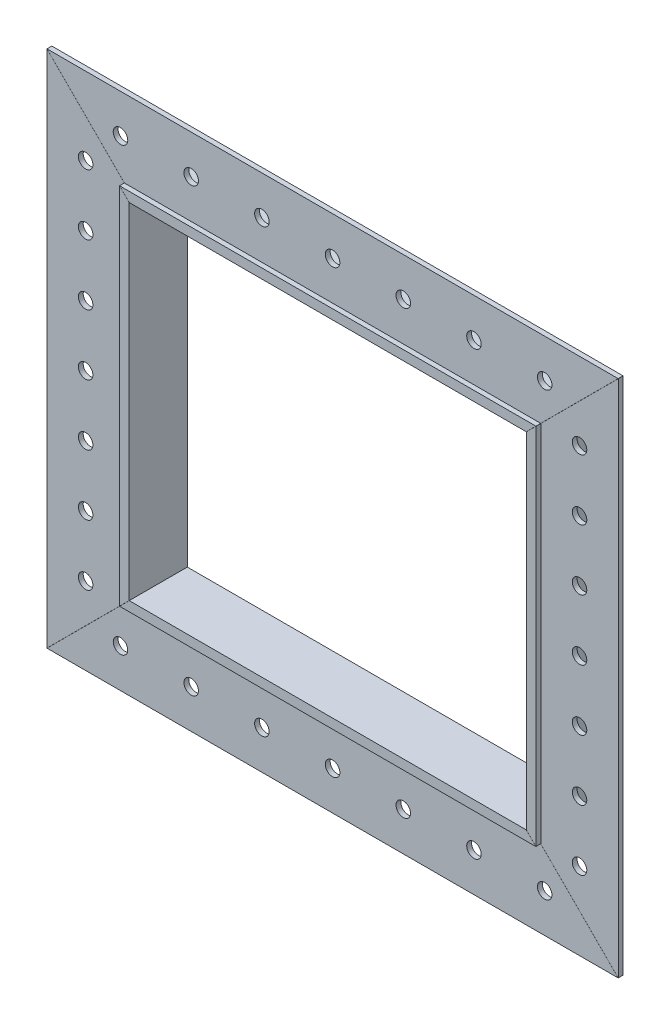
from build123d import *

# Parameters (mm, degrees)
SKETCH1_W                    = 136.525
SKETCH1_H                    = 119.38
SKETCH1_W_2                  = 130.175
SKETCH1_H_2                  = 113.03
BOSS_EXTRUDE1_DEPTH          = 9.525
SKETCH2_W                    = 187.325
SKETCH2_H                    = 170.18
SKETCH2_W_2                  = 136.525
SKETCH2_H_2                  = 119.38
BOSS_EXTRUDE2_DEPTH          = 1.5875
CUT_EXTRUDE_THIN1_DEPTH      = 128.741578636
CUT_EXTRUDE_THIN1_DEPTH_BACK = 128.741578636
SKETCH5_R                    = 2.38125
CUT_EXTRUDE1_DEPTH           = 1.5875


with BuildPart() as part:
    # Sketch1 → Boss-Extrude1 (new, symmetric)
    with BuildSketch(Plane.XY):
        Rectangle(SKETCH1_W, SKETCH1_H)
        Rectangle(SKETCH1_W_2, SKETCH1_H_2, mode=Mode.SUBTRACT)
    extrude(amount=BOSS_EXTRUDE1_DEPTH, both=True)

    # Sketch2 → Boss-Extrude2 (add)
    with BuildSketch(Plane.XY.offset(7.9375)):
        Rectangle(SKETCH2_W, SKETCH2_H)
        Rectangle(SKETCH2_W_2, SKETCH2_H_2, mode=Mode.SUBTRACT)
    extrude(amount=-BOSS_EXTRUDE2_DEPTH)

    # Sketch3 → Cut-Extrude-Thin1 (cut, two sides: drawn at the far end of the back side and taken through both)
    with BuildSketch(Plane.XY.offset(7.9375).offset(-CUT_EXTRUDE_THIN1_DEPTH_BACK)):
        Polygon((-93.671480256, 85.081019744), (-68.271480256, 59.681019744), (-65.096480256, 56.506019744), (-65.078519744, 56.523980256), (-68.253519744, 59.698980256), (-93.653519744, 85.098980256), align=None)
        Polygon((-93.653519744, -85.098980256), (-68.253519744, -59.698980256), (-65.078519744, -56.523980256), (-65.096480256, -56.506019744), (-68.271480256, -59.681019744), (-93.671480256, -85.081019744), align=None)
        Polygon((65.096480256, 56.506019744), (68.271480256, 59.681019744), (93.671480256, 85.081019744), (93.653519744, 85.098980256), (68.253519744, 59.698980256), (65.078519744, 56.523980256), align=None)
        Polygon((65.078519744, -56.523980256), (68.253519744, -59.698980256), (93.653519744, -85.098980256), (93.671480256, -85.081019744), (68.271480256, -59.681019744), (65.096480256, -56.506019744), align=None)
    extrude(amount=CUT_EXTRUDE_THIN1_DEPTH + CUT_EXTRUDE_THIN1_DEPTH_BACK, mode=Mode.SUBTRACT)


with BuildPart() as cut_extrude_thin1_piece_1:
    # of the separate pieces the step leaves, piece 1, a body of its own (cut_extrude_thin1_pieces)
    add(part.part.solids().sort_by_distance((93.644539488, -85.09, 6.35))[0])


with BuildPart() as cut_extrude_thin1_piece_2:
    # of the separate pieces the step leaves, piece 2, a body of its own (cut_extrude_thin1_pieces)
    add(part.part.solids().sort_by_distance((-68.244539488, 59.69, 6.35))[0])


with BuildPart() as cut_extrude_thin1_piece_3:
    # of the separate pieces the step leaves, piece 3, a body of its own (cut_extrude_thin1_pieces)
    add(part.part.solids().sort_by_distance((68.2625, 59.672039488, 6.35))[0])


with BuildPart() as cut_extrude_thin1_piece_4:
    # of the separate pieces the step leaves, piece 4, a body of its own (cut_extrude_thin1_pieces)
    add(part.part.solids().sort_by_distance((-68.2625, -59.672039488, 6.35))[0])


with BuildPart() as cut_extrude1_tool:
    # Sketch5 → Cut-Extrude1 (new body)
    with BuildSketch(Plane.XY.offset(7.9375)):
        with Locations((-69.5325, 72.39)):
            Circle(SKETCH5_R)
        with Locations((-46.355, 72.39)):
            Circle(SKETCH5_R)
        with Locations((-23.1775, 72.39)):
            Circle(SKETCH5_R)
        with Locations((0, 72.39)):
            Circle(SKETCH5_R)
        with Locations((23.1775, 72.39)):
            Circle(SKETCH5_R)
        with Locations((46.355, 72.39)):
            Circle(SKETCH5_R)
        with Locations((69.5325, 72.39)):
            Circle(SKETCH5_R)
        with Locations((80.9625, 59.69)):
            Circle(SKETCH5_R)
        with Locations((80.9625, 39.793333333)):
            Circle(SKETCH5_R)
        with Locations((80.9625, 19.896666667)):
            Circle(SKETCH5_R)
        with Locations((80.9625, 0)):
            Circle(SKETCH5_R)
        with Locations((80.9625, -19.896666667)):
            Circle(SKETCH5_R)
        with Locations((80.9625, -39.793333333)):
            Circle(SKETCH5_R)
        with Locations((80.9625, -59.69)):
            Circle(SKETCH5_R)
        with Locations((-80.9625, -59.69)):
            Circle(SKETCH5_R)
        with Locations((-80.9625, -39.793333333)):
            Circle(SKETCH5_R)
        with Locations((-80.9625, -19.896666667)):
            Circle(SKETCH5_R)
        with Locations((-80.9625, 0)):
            Circle(SKETCH5_R)
        with Locations((-80.9625, 19.896666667)):
            Circle(SKETCH5_R)
        with Locations((-80.9625, 39.793333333)):
            Circle(SKETCH5_R)
        with Locations((-80.9625, 59.69)):
            Circle(SKETCH5_R)
        with Locations((69.5325, -72.39)):
            Circle(SKETCH5_R)
        with Locations((46.355, -72.39)):
            Circle(SKETCH5_R)
        with Locations((23.1775, -72.39)):
            Circle(SKETCH5_R)
        with Locations((0, -72.39)):
            Circle(SKETCH5_R)
        with Locations((-23.1775, -72.39)):
            Circle(SKETCH5_R)
        with Locations((-46.355, -72.39)):
            Circle(SKETCH5_R)
        with Locations((-69.5325, -72.39)):
            Circle(SKETCH5_R)
    extrude(amount=-CUT_EXTRUDE1_DEPTH)


with BuildPart() as cut_extrude_thin1_piece_1_1:
    add(cut_extrude_thin1_piece_1.part)

    # Cut-Extrude1: cut by cut_extrude1_tool
    add(cut_extrude1_tool.part, mode=Mode.SUBTRACT)


with BuildPart() as cut_extrude_thin1_piece_2_1:
    add(cut_extrude_thin1_piece_2.part)

    # Cut-Extrude1: cut by cut_extrude1_tool
    add(cut_extrude1_tool.part, mode=Mode.SUBTRACT)


with BuildPart() as cut_extrude_thin1_piece_3_1:
    add(cut_extrude_thin1_piece_3.part)

    # Cut-Extrude1: cut by cut_extrude1_tool
    add(cut_extrude1_tool.part, mode=Mode.SUBTRACT)


with BuildPart() as cut_extrude_thin1_piece_4_1:
    add(cut_extrude_thin1_piece_4.part)

    # Cut-Extrude1: cut by cut_extrude1_tool
    add(cut_extrude1_tool.part, mode=Mode.SUBTRACT)


solid = Compound([cut_extrude_thin1_piece_1_1.part, cut_extrude_thin1_piece_2_1.part, cut_extrude_thin1_piece_3_1.part, cut_extrude_thin1_piece_4_1.part])
